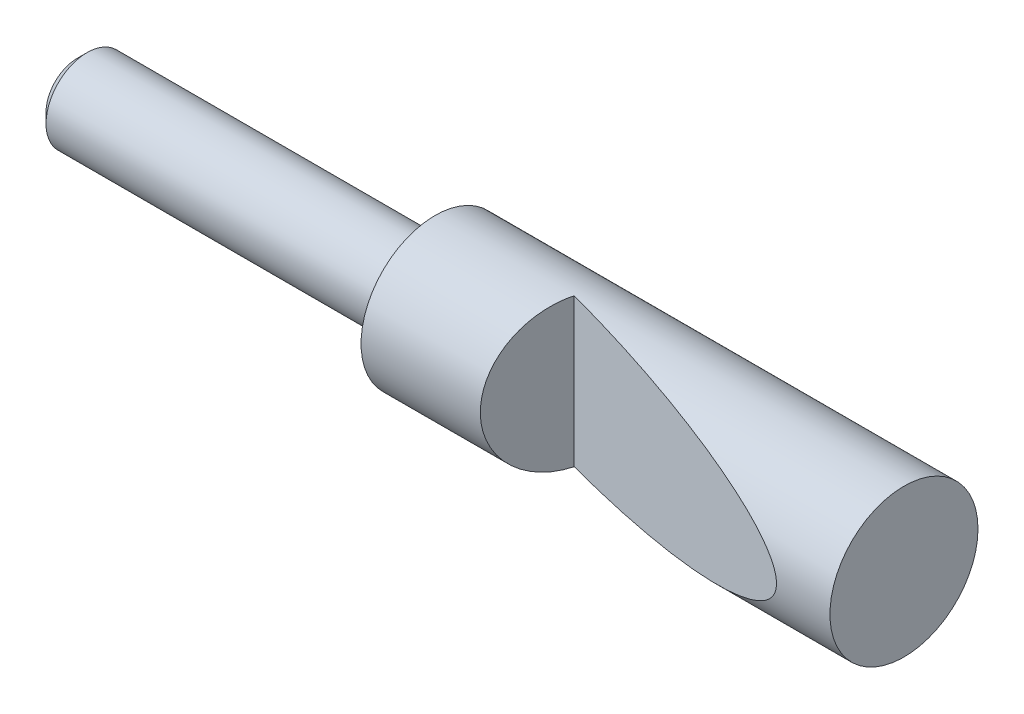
ISO-10303-21;
HEADER;
FILE_DESCRIPTION(('STEP AP214'),'2;1');
FILE_NAME('part.step','',(''),(''),'','','');
FILE_SCHEMA(('AUTOMOTIVE_DESIGN { 1 0 10303 214 1 1 1 1 }'));
ENDSEC;
DATA;
#1=APPLICATION_CONTEXT('core data for automotive mechanical design processes');
#2=APPLICATION_PROTOCOL_DEFINITION('international standard','automotive_design',2000,#1);
#3=PRODUCT_CONTEXT('',#1,'mechanical');
#4=PRODUCT('Part','Part','',(#3));
#5=PRODUCT_RELATED_PRODUCT_CATEGORY('part','',(#4));
#6=PRODUCT_DEFINITION_FORMATION('','',#4);
#7=PRODUCT_DEFINITION_CONTEXT('part definition',#1,'design');
#8=PRODUCT_DEFINITION('design','',#6,#7);
#9=PRODUCT_DEFINITION_SHAPE('','',#8);
#10=(LENGTH_UNIT() NAMED_UNIT(*) SI_UNIT(.MILLI.,.METRE.));
#11=(NAMED_UNIT(*) PLANE_ANGLE_UNIT() SI_UNIT($,.RADIAN.));
#12=(NAMED_UNIT(*) SI_UNIT($,.STERADIAN.) SOLID_ANGLE_UNIT());
#13=UNCERTAINTY_MEASURE_WITH_UNIT(LENGTH_MEASURE(1.E-05),#10,'distance_accuracy_value','');
#14=(GEOMETRIC_REPRESENTATION_CONTEXT(3) GLOBAL_UNCERTAINTY_ASSIGNED_CONTEXT((#13)) GLOBAL_UNIT_ASSIGNED_CONTEXT((#10,
#11,#12)) REPRESENTATION_CONTEXT('',''));
#15=CARTESIAN_POINT('',(0.,0.,0.));
#16=DIRECTION('',(0.,0.,1.));
#17=DIRECTION('',(1.,0.,0.));
#18=AXIS2_PLACEMENT_3D('',#15,#16,#17);
#19=CARTESIAN_POINT('',(0.,0.,0.));
#20=DIRECTION('',(1.,0.,0.));
#21=DIRECTION('',(0.,0.,-1.));
#22=AXIS2_PLACEMENT_3D('',#19,#20,#21);
#23=PLANE('',#22);
#24=CARTESIAN_POINT('',(0.,0.,0.));
#25=DIRECTION('',(1.,0.,0.));
#26=DIRECTION('',(0.,0.,-1.));
#27=AXIS2_PLACEMENT_3D('',#24,#25,#26);
#28=CIRCLE('',#27,9.);
#29=CARTESIAN_POINT('',(0.,0.,-9.));
#30=VERTEX_POINT('',#29);
#31=EDGE_CURVE('E40',#30,#30,#28,.T.);
#32=ORIENTED_EDGE('',*,*,#31,.T.);
#33=EDGE_LOOP('',(#32));
#34=FACE_BOUND('',#33,.T.);
#35=ADVANCED_FACE('F14',(#34),#23,.T.);
#36=CARTESIAN_POINT('',(-40.08845726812,-9.,0.));
#37=DIRECTION('',(0.258819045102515,0.,-0.96592582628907));
#38=DIRECTION('',(-0.96592582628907,0.,-0.258819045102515));
#39=AXIS2_PLACEMENT_3D('',#36,#37,#38);
#40=PLANE('',#39);
#41=CARTESIAN_POINT('',(-40.08845726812,0.,0.));
#42=DIRECTION('',(0.258819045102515,0.,-0.96592582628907));
#43=DIRECTION('',(0.96592582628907,0.,0.258819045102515));
#44=AXIS2_PLACEMENT_3D('',#41,#42,#43);
#45=ELLIPSE('',#44,34.7733297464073,9.);
#46=CARTESIAN_POINT('',(-40.08845726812,-9.,0.));
#47=VERTEX_POINT('',#46);
#48=CARTESIAN_POINT('',(-40.08845726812,9.,0.));
#49=VERTEX_POINT('',#48);
#50=EDGE_CURVE('E36',#47,#49,#45,.F.);
#51=ORIENTED_EDGE('',*,*,#50,.T.);
#52=DIRECTION('',(0.,1.,0.));
#53=VECTOR('',#52,1.);
#54=CARTESIAN_POINT('',(-40.08845726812,-9.,0.));
#55=LINE('',#54,#53);
#56=EDGE_CURVE('E28',#47,#49,#55,.T.);
#57=ORIENTED_EDGE('',*,*,#56,.F.);
#58=EDGE_LOOP('',(#51,#57));
#59=FACE_BOUND('',#58,.T.);
#60=ADVANCED_FACE('F39',(#59),#40,.F.);
#61=CARTESIAN_POINT('',(-42.5,-9.,9.));
#62=DIRECTION('',(-0.965925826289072,0.,-0.258819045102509));
#63=DIRECTION('',(-0.258819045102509,0.,0.965925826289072));
#64=AXIS2_PLACEMENT_3D('',#61,#62,#63);
#65=PLANE('',#64);
#66=ORIENTED_EDGE('',*,*,#56,.T.);
#67=CARTESIAN_POINT('',(-40.08845726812,0.,0.));
#68=DIRECTION('',(-0.965925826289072,0.,-0.258819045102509));
#69=DIRECTION('',(0.258819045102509,0.,-0.965925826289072));
#70=AXIS2_PLACEMENT_3D('',#67,#68,#69);
#71=ELLIPSE('',#70,9.31748562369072,9.);
#72=EDGE_CURVE('E33',#49,#47,#71,.F.);
#73=ORIENTED_EDGE('',*,*,#72,.T.);
#74=EDGE_LOOP('',(#66,#73));
#75=FACE_BOUND('',#74,.T.);
#76=ADVANCED_FACE('F42',(#75),#65,.F.);
#77=CARTESIAN_POINT('',(0.,0.,0.));
#78=DIRECTION('',(1.,0.,0.));
#79=DIRECTION('',(0.,0.,-1.));
#80=AXIS2_PLACEMENT_3D('',#77,#78,#79);
#81=CYLINDRICAL_SURFACE('',#80,9.);
#82=ORIENTED_EDGE('',*,*,#72,.F.);
#83=ORIENTED_EDGE('',*,*,#50,.F.);
#84=EDGE_LOOP('',(#82,#83));
#85=FACE_BOUND('',#84,.T.);
#86=CARTESIAN_POINT('',(-57.,0.,0.));
#87=DIRECTION('',(1.,0.,0.));
#88=DIRECTION('',(0.,0.,-1.));
#89=AXIS2_PLACEMENT_3D('',#86,#87,#88);
#90=CIRCLE('',#89,9.);
#91=CARTESIAN_POINT('',(-57.,0.,-9.));
#92=VERTEX_POINT('',#91);
#93=EDGE_CURVE('E43',#92,#92,#90,.T.);
#94=ORIENTED_EDGE('',*,*,#93,.T.);
#95=EDGE_LOOP('',(#94));
#96=FACE_BOUND('',#95,.T.);
#97=ORIENTED_EDGE('',*,*,#31,.F.);
#98=EDGE_LOOP('',(#97));
#99=FACE_BOUND('',#98,.T.);
#100=ADVANCED_FACE('F34',(#85,#96,#99),#81,.T.);
#101=CARTESIAN_POINT('',(-57.,9.,0.));
#102=DIRECTION('',(-1.,0.,0.));
#103=DIRECTION('',(0.,0.,1.));
#104=AXIS2_PLACEMENT_3D('',#101,#102,#103);
#105=PLANE('',#104);
#106=CARTESIAN_POINT('',(-57.,0.,0.));
#107=DIRECTION('',(-1.,0.,0.));
#108=DIRECTION('',(0.,-1.,0.));
#109=AXIS2_PLACEMENT_3D('',#106,#107,#108);
#110=CIRCLE('',#109,5.);
#111=CARTESIAN_POINT('',(-57.,-5.,0.));
#112=VERTEX_POINT('',#111);
#113=EDGE_CURVE('E9',#112,#112,#110,.F.);
#114=ORIENTED_EDGE('',*,*,#113,.T.);
#115=EDGE_LOOP('',(#114));
#116=FACE_BOUND('',#115,.T.);
#117=ORIENTED_EDGE('',*,*,#93,.F.);
#118=EDGE_LOOP('',(#117));
#119=FACE_BOUND('',#118,.T.);
#120=ADVANCED_FACE('F68',(#116,#119),#105,.T.);
#121=CARTESIAN_POINT('',(-100.5,0.,0.));
#122=DIRECTION('',(-1.,0.,0.));
#123=DIRECTION('',(0.,-1.,0.));
#124=AXIS2_PLACEMENT_3D('',#121,#122,#123);
#125=CYLINDRICAL_SURFACE('',#124,5.);
#126=ORIENTED_EDGE('',*,*,#113,.F.);
#127=EDGE_LOOP('',(#126));
#128=FACE_BOUND('',#127,.T.);
#129=CARTESIAN_POINT('',(-99.3,0.,0.));
#130=DIRECTION('',(1.,0.,0.));
#131=DIRECTION('',(0.,0.,1.));
#132=AXIS2_PLACEMENT_3D('',#129,#130,#131);
#133=CIRCLE('',#132,5.);
#134=CARTESIAN_POINT('',(-99.3,0.,5.));
#135=VERTEX_POINT('',#134);
#136=EDGE_CURVE('E44',#135,#135,#133,.T.);
#137=ORIENTED_EDGE('',*,*,#136,.T.);
#138=EDGE_LOOP('',(#137));
#139=FACE_BOUND('',#138,.T.);
#140=ADVANCED_FACE('F16',(#128,#139),#125,.T.);
#141=CARTESIAN_POINT('',(-100.5,0.,3.8));
#142=DIRECTION('',(-1.,0.,0.));
#143=DIRECTION('',(0.,-1.,0.));
#144=AXIS2_PLACEMENT_3D('',#141,#142,#143);
#145=PLANE('',#144);
#146=CARTESIAN_POINT('',(-100.5,0.,0.));
#147=DIRECTION('',(-1.,0.,0.));
#148=DIRECTION('',(0.,-1.,0.));
#149=AXIS2_PLACEMENT_3D('',#146,#147,#148);
#150=CIRCLE('',#149,3.8);
#151=CARTESIAN_POINT('',(-100.5,-3.8,0.));
#152=VERTEX_POINT('',#151);
#153=EDGE_CURVE('E22',#152,#152,#150,.T.);
#154=ORIENTED_EDGE('',*,*,#153,.T.);
#155=EDGE_LOOP('',(#154));
#156=FACE_BOUND('',#155,.T.);
#157=ADVANCED_FACE('F55',(#156),#145,.T.);
#158=CARTESIAN_POINT('',(-100.5,0.,0.));
#159=DIRECTION('',(1.,0.,0.));
#160=DIRECTION('',(0.,1.,0.));
#161=AXIS2_PLACEMENT_3D('',#158,#159,#160);
#162=CONICAL_SURFACE('',#161,3.8,0.785398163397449);
#163=ORIENTED_EDGE('',*,*,#136,.F.);
#164=EDGE_LOOP('',(#163));
#165=FACE_BOUND('',#164,.T.);
#166=ORIENTED_EDGE('',*,*,#153,.F.);
#167=EDGE_LOOP('',(#166));
#168=FACE_BOUND('',#167,.T.);
#169=ADVANCED_FACE('F57',(#165,#168),#162,.T.);
#170=CLOSED_SHELL('',(#35,#60,#76,#100,#120,#140,#157,#169));
#171=MANIFOLD_SOLID_BREP('B1',#170);
#172=ADVANCED_BREP_SHAPE_REPRESENTATION('',(#18,#171),#14);
#173=SHAPE_DEFINITION_REPRESENTATION(#9,#172);
ENDSEC;
END-ISO-10303-21;
